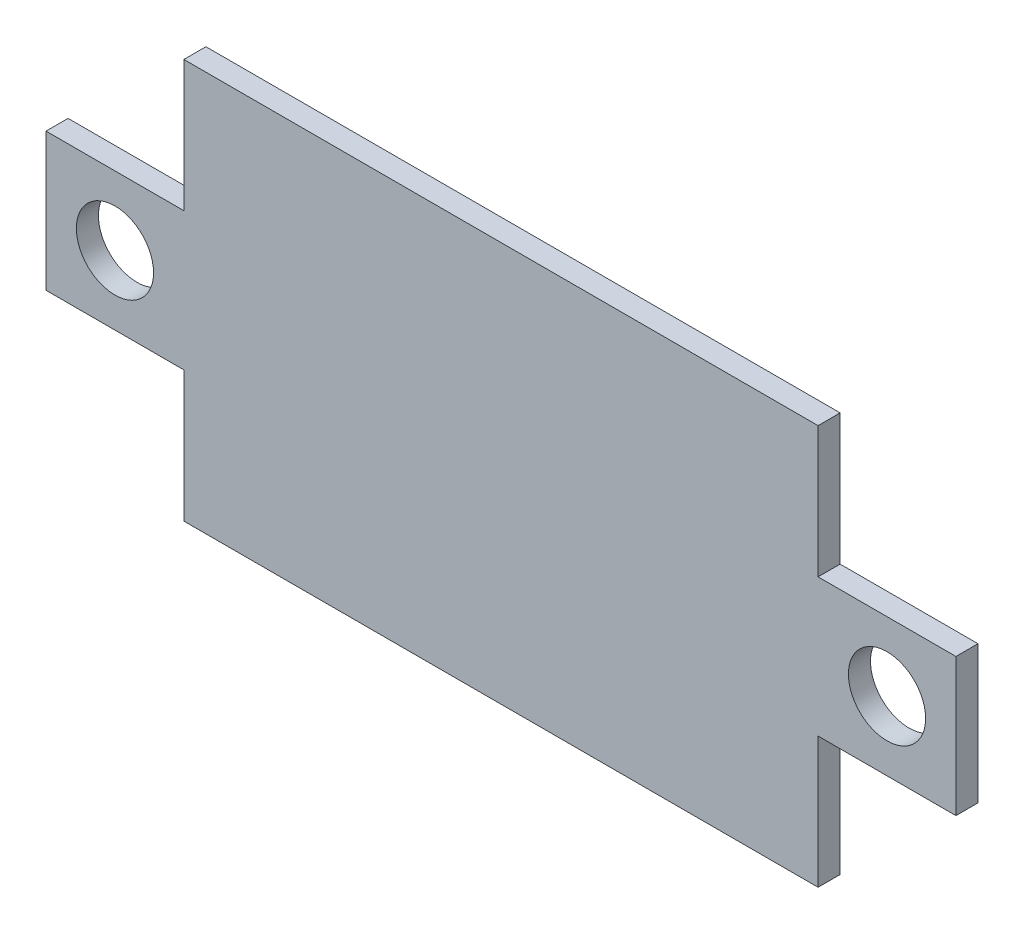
ISO-10303-21;
HEADER;
FILE_DESCRIPTION(('STEP AP214'),'2;1');
FILE_NAME('part.step','',(''),(''),'','','');
FILE_SCHEMA(('AUTOMOTIVE_DESIGN { 1 0 10303 214 1 1 1 1 }'));
ENDSEC;
DATA;
#1=APPLICATION_CONTEXT('core data for automotive mechanical design processes');
#2=APPLICATION_PROTOCOL_DEFINITION('international standard','automotive_design',2000,#1);
#3=PRODUCT_CONTEXT('',#1,'mechanical');
#4=PRODUCT('Part','Part','',(#3));
#5=PRODUCT_RELATED_PRODUCT_CATEGORY('part','',(#4));
#6=PRODUCT_DEFINITION_FORMATION('','',#4);
#7=PRODUCT_DEFINITION_CONTEXT('part definition',#1,'design');
#8=PRODUCT_DEFINITION('design','',#6,#7);
#9=PRODUCT_DEFINITION_SHAPE('','',#8);
#10=(LENGTH_UNIT() NAMED_UNIT(*) SI_UNIT(.MILLI.,.METRE.));
#11=(NAMED_UNIT(*) PLANE_ANGLE_UNIT() SI_UNIT($,.RADIAN.));
#12=(NAMED_UNIT(*) SI_UNIT($,.STERADIAN.) SOLID_ANGLE_UNIT());
#13=UNCERTAINTY_MEASURE_WITH_UNIT(LENGTH_MEASURE(1.E-05),#10,'distance_accuracy_value','');
#14=(GEOMETRIC_REPRESENTATION_CONTEXT(3) GLOBAL_UNCERTAINTY_ASSIGNED_CONTEXT((#13)) GLOBAL_UNIT_ASSIGNED_CONTEXT((#10,
#11,#12)) REPRESENTATION_CONTEXT('',''));
#15=CARTESIAN_POINT('',(0.,0.,0.));
#16=DIRECTION('',(0.,0.,1.));
#17=DIRECTION('',(1.,0.,0.));
#18=AXIS2_PLACEMENT_3D('',#15,#16,#17);
#19=CARTESIAN_POINT('',(0.,0.,0.4));
#20=DIRECTION('',(0.,-1.,0.));
#21=DIRECTION('',(0.,0.,-1.));
#22=AXIS2_PLACEMENT_3D('',#19,#20,#21);
#23=PLANE('',#22);
#24=DIRECTION('',(-1.,0.,0.));
#25=VECTOR('',#24,1.);
#26=CARTESIAN_POINT('',(0.,0.,-0.4));
#27=LINE('',#26,#25);
#28=CARTESIAN_POINT('',(0.,0.,-0.4));
#29=VERTEX_POINT('',#28);
#30=CARTESIAN_POINT('',(-23.,0.,-0.4));
#31=VERTEX_POINT('',#30);
#32=EDGE_CURVE('E177',#29,#31,#27,.T.);
#33=ORIENTED_EDGE('',*,*,#32,.T.);
#34=DIRECTION('',(0.,0.,-1.));
#35=VECTOR('',#34,1.);
#36=CARTESIAN_POINT('',(-23.,0.,0.4));
#37=LINE('',#36,#35);
#38=CARTESIAN_POINT('',(-23.,0.,0.4));
#39=VERTEX_POINT('',#38);
#40=EDGE_CURVE('E11',#39,#31,#37,.T.);
#41=ORIENTED_EDGE('',*,*,#40,.F.);
#42=DIRECTION('',(-1.,0.,0.));
#43=VECTOR('',#42,1.);
#44=CARTESIAN_POINT('',(0.,0.,0.4));
#45=LINE('',#44,#43);
#46=CARTESIAN_POINT('',(0.,0.,0.4));
#47=VERTEX_POINT('',#46);
#48=EDGE_CURVE('E221',#47,#39,#45,.T.);
#49=ORIENTED_EDGE('',*,*,#48,.F.);
#50=DIRECTION('',(0.,0.,-1.));
#51=VECTOR('',#50,1.);
#52=CARTESIAN_POINT('',(0.,0.,0.4));
#53=LINE('',#52,#51);
#54=EDGE_CURVE('E58',#47,#29,#53,.T.);
#55=ORIENTED_EDGE('',*,*,#54,.T.);
#56=EDGE_LOOP('',(#33,#41,#49,#55));
#57=FACE_BOUND('',#56,.T.);
#58=ADVANCED_FACE('F41',(#57),#23,.F.);
#59=CARTESIAN_POINT('',(-23.,0.,0.4));
#60=DIRECTION('',(1.,0.,0.));
#61=DIRECTION('',(0.,1.,0.));
#62=AXIS2_PLACEMENT_3D('',#59,#60,#61);
#63=PLANE('',#62);
#64=DIRECTION('',(0.,-1.,0.));
#65=VECTOR('',#64,1.);
#66=CARTESIAN_POINT('',(-23.,0.,-0.4));
#67=LINE('',#66,#65);
#68=CARTESIAN_POINT('',(-23.,-4.75,-0.4));
#69=VERTEX_POINT('',#68);
#70=EDGE_CURVE('E180',#31,#69,#67,.T.);
#71=ORIENTED_EDGE('',*,*,#70,.T.);
#72=DIRECTION('',(0.,0.,-1.));
#73=VECTOR('',#72,1.);
#74=CARTESIAN_POINT('',(-23.,-4.75,0.4));
#75=LINE('',#74,#73);
#76=CARTESIAN_POINT('',(-23.,-4.75,0.4));
#77=VERTEX_POINT('',#76);
#78=EDGE_CURVE('E50',#77,#69,#75,.T.);
#79=ORIENTED_EDGE('',*,*,#78,.F.);
#80=DIRECTION('',(0.,-1.,0.));
#81=VECTOR('',#80,1.);
#82=CARTESIAN_POINT('',(-23.,0.,0.4));
#83=LINE('',#82,#81);
#84=EDGE_CURVE('E108',#39,#77,#83,.T.);
#85=ORIENTED_EDGE('',*,*,#84,.F.);
#86=ORIENTED_EDGE('',*,*,#40,.T.);
#87=EDGE_LOOP('',(#71,#79,#85,#86));
#88=FACE_BOUND('',#87,.T.);
#89=ADVANCED_FACE('F291',(#88),#63,.F.);
#90=CARTESIAN_POINT('',(0.,-4.75000000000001,0.4));
#91=DIRECTION('',(0.,-1.,0.));
#92=DIRECTION('',(1.,0.,0.));
#93=AXIS2_PLACEMENT_3D('',#90,#91,#92);
#94=PLANE('',#93);
#95=DIRECTION('',(-1.,0.,0.));
#96=VECTOR('',#95,1.);
#97=CARTESIAN_POINT('',(0.,-4.75000000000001,-0.4));
#98=LINE('',#97,#96);
#99=CARTESIAN_POINT('',(-28.,-4.75,-0.4));
#100=VERTEX_POINT('',#99);
#101=EDGE_CURVE('E183',#69,#100,#98,.T.);
#102=ORIENTED_EDGE('',*,*,#101,.T.);
#103=DIRECTION('',(0.,0.,-1.));
#104=VECTOR('',#103,1.);
#105=CARTESIAN_POINT('',(-28.,-4.75,0.4));
#106=LINE('',#105,#104);
#107=CARTESIAN_POINT('',(-28.,-4.75,0.4));
#108=VERTEX_POINT('',#107);
#109=EDGE_CURVE('E243',#108,#100,#106,.T.);
#110=ORIENTED_EDGE('',*,*,#109,.F.);
#111=DIRECTION('',(-1.,0.,0.));
#112=VECTOR('',#111,1.);
#113=CARTESIAN_POINT('',(0.,-4.75000000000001,0.4));
#114=LINE('',#113,#112);
#115=EDGE_CURVE('E253',#77,#108,#114,.T.);
#116=ORIENTED_EDGE('',*,*,#115,.F.);
#117=ORIENTED_EDGE('',*,*,#78,.T.);
#118=EDGE_LOOP('',(#102,#110,#116,#117));
#119=FACE_BOUND('',#118,.T.);
#120=ADVANCED_FACE('F251',(#119),#94,.F.);
#121=CARTESIAN_POINT('',(-28.,0.,0.4));
#122=DIRECTION('',(1.,0.,0.));
#123=DIRECTION('',(0.,0.,-1.));
#124=AXIS2_PLACEMENT_3D('',#121,#122,#123);
#125=PLANE('',#124);
#126=DIRECTION('',(0.,-1.,0.));
#127=VECTOR('',#126,1.);
#128=CARTESIAN_POINT('',(-28.,0.,-0.4));
#129=LINE('',#128,#127);
#130=CARTESIAN_POINT('',(-28.,-9.75,-0.4));
#131=VERTEX_POINT('',#130);
#132=EDGE_CURVE('E187',#100,#131,#129,.T.);
#133=ORIENTED_EDGE('',*,*,#132,.T.);
#134=DIRECTION('',(0.,0.,-1.));
#135=VECTOR('',#134,1.);
#136=CARTESIAN_POINT('',(-28.,-9.75,0.4));
#137=LINE('',#136,#135);
#138=CARTESIAN_POINT('',(-28.,-9.75,0.4));
#139=VERTEX_POINT('',#138);
#140=EDGE_CURVE('E240',#139,#131,#137,.T.);
#141=ORIENTED_EDGE('',*,*,#140,.F.);
#142=DIRECTION('',(0.,-1.,0.));
#143=VECTOR('',#142,1.);
#144=CARTESIAN_POINT('',(-28.,0.,0.4));
#145=LINE('',#144,#143);
#146=EDGE_CURVE('E265',#108,#139,#145,.T.);
#147=ORIENTED_EDGE('',*,*,#146,.F.);
#148=ORIENTED_EDGE('',*,*,#109,.T.);
#149=EDGE_LOOP('',(#133,#141,#147,#148));
#150=FACE_BOUND('',#149,.T.);
#151=ADVANCED_FACE('F262',(#150),#125,.F.);
#152=CARTESIAN_POINT('',(0.,-9.74999999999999,0.4));
#153=DIRECTION('',(0.,-1.,0.));
#154=DIRECTION('',(1.,0.,0.));
#155=AXIS2_PLACEMENT_3D('',#152,#153,#154);
#156=PLANE('',#155);
#157=DIRECTION('',(-1.,0.,0.));
#158=VECTOR('',#157,1.);
#159=CARTESIAN_POINT('',(0.,-9.74999999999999,-0.4));
#160=LINE('',#159,#158);
#161=CARTESIAN_POINT('',(-23.,-9.75,-0.4));
#162=VERTEX_POINT('',#161);
#163=EDGE_CURVE('E191',#162,#131,#160,.T.);
#164=ORIENTED_EDGE('',*,*,#163,.F.);
#165=DIRECTION('',(0.,0.,-1.));
#166=VECTOR('',#165,1.);
#167=CARTESIAN_POINT('',(-23.,-9.75,0.4));
#168=LINE('',#167,#166);
#169=CARTESIAN_POINT('',(-23.,-9.75,0.4));
#170=VERTEX_POINT('',#169);
#171=EDGE_CURVE('E237',#170,#162,#168,.T.);
#172=ORIENTED_EDGE('',*,*,#171,.F.);
#173=DIRECTION('',(-1.,0.,0.));
#174=VECTOR('',#173,1.);
#175=CARTESIAN_POINT('',(0.,-9.74999999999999,0.4));
#176=LINE('',#175,#174);
#177=EDGE_CURVE('E268',#170,#139,#176,.T.);
#178=ORIENTED_EDGE('',*,*,#177,.T.);
#179=ORIENTED_EDGE('',*,*,#140,.T.);
#180=EDGE_LOOP('',(#164,#172,#178,#179));
#181=FACE_BOUND('',#180,.T.);
#182=ADVANCED_FACE('F303',(#181),#156,.T.);
#183=CARTESIAN_POINT('',(-23.,-14.5,-0.4));
#184=VERTEX_POINT('',#183);
#185=EDGE_CURVE('E184',#162,#184,#67,.T.);
#186=ORIENTED_EDGE('',*,*,#185,.T.);
#187=DIRECTION('',(0.,0.,-1.));
#188=VECTOR('',#187,1.);
#189=CARTESIAN_POINT('',(-23.,-14.5,0.4));
#190=LINE('',#189,#188);
#191=CARTESIAN_POINT('',(-23.,-14.5,0.4));
#192=VERTEX_POINT('',#191);
#193=EDGE_CURVE('E234',#192,#184,#190,.T.);
#194=ORIENTED_EDGE('',*,*,#193,.F.);
#195=EDGE_CURVE('E272',#170,#192,#83,.T.);
#196=ORIENTED_EDGE('',*,*,#195,.F.);
#197=ORIENTED_EDGE('',*,*,#171,.T.);
#198=EDGE_LOOP('',(#186,#194,#196,#197));
#199=FACE_BOUND('',#198,.T.);
#200=ADVANCED_FACE('F294',(#199),#63,.F.);
#201=CARTESIAN_POINT('',(0.,-14.5,0.4));
#202=DIRECTION('',(0.,-1.,0.));
#203=DIRECTION('',(1.,0.,0.));
#204=AXIS2_PLACEMENT_3D('',#201,#202,#203);
#205=PLANE('',#204);
#206=DIRECTION('',(-1.,0.,0.));
#207=VECTOR('',#206,1.);
#208=CARTESIAN_POINT('',(0.,-14.5,-0.4));
#209=LINE('',#208,#207);
#210=CARTESIAN_POINT('',(0.,-14.5,-0.4));
#211=VERTEX_POINT('',#210);
#212=EDGE_CURVE('E195',#211,#184,#209,.T.);
#213=ORIENTED_EDGE('',*,*,#212,.F.);
#214=DIRECTION('',(0.,0.,-1.));
#215=VECTOR('',#214,1.);
#216=CARTESIAN_POINT('',(0.,-14.5,0.4));
#217=LINE('',#216,#215);
#218=CARTESIAN_POINT('',(0.,-14.5,0.4));
#219=VERTEX_POINT('',#218);
#220=EDGE_CURVE('E231',#219,#211,#217,.T.);
#221=ORIENTED_EDGE('',*,*,#220,.F.);
#222=DIRECTION('',(-1.,0.,0.));
#223=VECTOR('',#222,1.);
#224=CARTESIAN_POINT('',(0.,-14.5,0.4));
#225=LINE('',#224,#223);
#226=EDGE_CURVE('E277',#219,#192,#225,.T.);
#227=ORIENTED_EDGE('',*,*,#226,.T.);
#228=ORIENTED_EDGE('',*,*,#193,.T.);
#229=EDGE_LOOP('',(#213,#221,#227,#228));
#230=FACE_BOUND('',#229,.T.);
#231=ADVANCED_FACE('F302',(#230),#205,.T.);
#232=CARTESIAN_POINT('',(0.,0.,0.4));
#233=DIRECTION('',(1.,0.,0.));
#234=DIRECTION('',(0.,1.,0.));
#235=AXIS2_PLACEMENT_3D('',#232,#233,#234);
#236=PLANE('',#235);
#237=DIRECTION('',(0.,-1.,0.));
#238=VECTOR('',#237,1.);
#239=CARTESIAN_POINT('',(0.,0.,-0.4));
#240=LINE('',#239,#238);
#241=CARTESIAN_POINT('',(0.,-9.75,-0.4));
#242=VERTEX_POINT('',#241);
#243=EDGE_CURVE('E199',#242,#211,#240,.T.);
#244=ORIENTED_EDGE('',*,*,#243,.F.);
#245=DIRECTION('',(0.,0.,-1.));
#246=VECTOR('',#245,1.);
#247=CARTESIAN_POINT('',(0.,-9.75,0.4));
#248=LINE('',#247,#246);
#249=CARTESIAN_POINT('',(0.,-9.75,0.4));
#250=VERTEX_POINT('',#249);
#251=EDGE_CURVE('E228',#250,#242,#248,.T.);
#252=ORIENTED_EDGE('',*,*,#251,.F.);
#253=DIRECTION('',(0.,-1.,0.));
#254=VECTOR('',#253,1.);
#255=CARTESIAN_POINT('',(0.,0.,0.4));
#256=LINE('',#255,#254);
#257=EDGE_CURVE('E167',#250,#219,#256,.T.);
#258=ORIENTED_EDGE('',*,*,#257,.T.);
#259=ORIENTED_EDGE('',*,*,#220,.T.);
#260=EDGE_LOOP('',(#244,#252,#258,#259));
#261=FACE_BOUND('',#260,.T.);
#262=ADVANCED_FACE('F309',(#261),#236,.T.);
#263=CARTESIAN_POINT('',(0.,-9.75,0.4));
#264=DIRECTION('',(0.,1.,0.));
#265=DIRECTION('',(0.,0.,1.));
#266=AXIS2_PLACEMENT_3D('',#263,#264,#265);
#267=PLANE('',#266);
#268=DIRECTION('',(1.,0.,0.));
#269=VECTOR('',#268,1.);
#270=CARTESIAN_POINT('',(0.,-9.75,-0.4));
#271=LINE('',#270,#269);
#272=CARTESIAN_POINT('',(5.,-9.75,-0.4));
#273=VERTEX_POINT('',#272);
#274=EDGE_CURVE('E203',#242,#273,#271,.T.);
#275=ORIENTED_EDGE('',*,*,#274,.T.);
#276=DIRECTION('',(0.,0.,-1.));
#277=VECTOR('',#276,1.);
#278=CARTESIAN_POINT('',(5.,-9.75,0.4));
#279=LINE('',#278,#277);
#280=CARTESIAN_POINT('',(5.,-9.75,0.4));
#281=VERTEX_POINT('',#280);
#282=EDGE_CURVE('E146',#281,#273,#279,.T.);
#283=ORIENTED_EDGE('',*,*,#282,.F.);
#284=DIRECTION('',(1.,0.,0.));
#285=VECTOR('',#284,1.);
#286=CARTESIAN_POINT('',(0.,-9.75,0.4));
#287=LINE('',#286,#285);
#288=EDGE_CURVE('E156',#250,#281,#287,.T.);
#289=ORIENTED_EDGE('',*,*,#288,.F.);
#290=ORIENTED_EDGE('',*,*,#251,.T.);
#291=EDGE_LOOP('',(#275,#283,#289,#290));
#292=FACE_BOUND('',#291,.T.);
#293=ADVANCED_FACE('F319',(#292),#267,.F.);
#294=CARTESIAN_POINT('',(5.,0.,0.4));
#295=DIRECTION('',(1.,0.,0.));
#296=DIRECTION('',(0.,1.,0.));
#297=AXIS2_PLACEMENT_3D('',#294,#295,#296);
#298=PLANE('',#297);
#299=DIRECTION('',(0.,-1.,0.));
#300=VECTOR('',#299,1.);
#301=CARTESIAN_POINT('',(5.,0.,-0.4));
#302=LINE('',#301,#300);
#303=CARTESIAN_POINT('',(5.,-4.75,-0.4));
#304=VERTEX_POINT('',#303);
#305=EDGE_CURVE('E141',#304,#273,#302,.T.);
#306=ORIENTED_EDGE('',*,*,#305,.F.);
#307=DIRECTION('',(0.,0.,-1.));
#308=VECTOR('',#307,1.);
#309=CARTESIAN_POINT('',(5.,-4.75,0.4));
#310=LINE('',#309,#308);
#311=CARTESIAN_POINT('',(5.,-4.75,0.4));
#312=VERTEX_POINT('',#311);
#313=EDGE_CURVE('E136',#312,#304,#310,.T.);
#314=ORIENTED_EDGE('',*,*,#313,.F.);
#315=DIRECTION('',(0.,-1.,0.));
#316=VECTOR('',#315,1.);
#317=CARTESIAN_POINT('',(5.,0.,0.4));
#318=LINE('',#317,#316);
#319=EDGE_CURVE('E139',#312,#281,#318,.T.);
#320=ORIENTED_EDGE('',*,*,#319,.T.);
#321=ORIENTED_EDGE('',*,*,#282,.T.);
#322=EDGE_LOOP('',(#306,#314,#320,#321));
#323=FACE_BOUND('',#322,.T.);
#324=ADVANCED_FACE('F138',(#323),#298,.T.);
#325=CARTESIAN_POINT('',(0.,-4.75,0.4));
#326=DIRECTION('',(0.,1.,0.));
#327=DIRECTION('',(-1.,0.,0.));
#328=AXIS2_PLACEMENT_3D('',#325,#326,#327);
#329=PLANE('',#328);
#330=DIRECTION('',(1.,0.,0.));
#331=VECTOR('',#330,1.);
#332=CARTESIAN_POINT('',(0.,-4.75,-0.4));
#333=LINE('',#332,#331);
#334=CARTESIAN_POINT('',(0.,-4.75,-0.4));
#335=VERTEX_POINT('',#334);
#336=EDGE_CURVE('E210',#335,#304,#333,.T.);
#337=ORIENTED_EDGE('',*,*,#336,.F.);
#338=DIRECTION('',(0.,0.,-1.));
#339=VECTOR('',#338,1.);
#340=CARTESIAN_POINT('',(0.,-4.75,0.4));
#341=LINE('',#340,#339);
#342=CARTESIAN_POINT('',(0.,-4.75,0.4));
#343=VERTEX_POINT('',#342);
#344=EDGE_CURVE('E96',#343,#335,#341,.T.);
#345=ORIENTED_EDGE('',*,*,#344,.F.);
#346=DIRECTION('',(1.,0.,0.));
#347=VECTOR('',#346,1.);
#348=CARTESIAN_POINT('',(0.,-4.75,0.4));
#349=LINE('',#348,#347);
#350=EDGE_CURVE('E153',#343,#312,#349,.T.);
#351=ORIENTED_EDGE('',*,*,#350,.T.);
#352=ORIENTED_EDGE('',*,*,#313,.T.);
#353=EDGE_LOOP('',(#337,#345,#351,#352));
#354=FACE_BOUND('',#353,.T.);
#355=ADVANCED_FACE('F160',(#354),#329,.T.);
#356=CARTESIAN_POINT('',(2.5,-7.25,0.4));
#357=DIRECTION('',(0.,0.,-1.));
#358=DIRECTION('',(-1.,0.,0.));
#359=AXIS2_PLACEMENT_3D('',#356,#357,#358);
#360=CYLINDRICAL_SURFACE('',#359,1.4);
#361=CARTESIAN_POINT('',(2.5,-7.25,0.4));
#362=DIRECTION('',(0.,0.,1.));
#363=DIRECTION('',(1.,0.,0.));
#364=AXIS2_PLACEMENT_3D('',#361,#362,#363);
#365=CIRCLE('',#364,1.4);
#366=CARTESIAN_POINT('',(3.9,-7.25,0.4));
#367=VERTEX_POINT('',#366);
#368=EDGE_CURVE('E165',#367,#367,#365,.T.);
#369=ORIENTED_EDGE('',*,*,#368,.T.);
#370=EDGE_LOOP('',(#369));
#371=FACE_BOUND('',#370,.T.);
#372=CARTESIAN_POINT('',(2.5,-7.25,-0.4));
#373=DIRECTION('',(0.,0.,1.));
#374=DIRECTION('',(1.,0.,0.));
#375=AXIS2_PLACEMENT_3D('',#372,#373,#374);
#376=CIRCLE('',#375,1.4);
#377=CARTESIAN_POINT('',(3.9,-7.25,-0.4));
#378=VERTEX_POINT('',#377);
#379=EDGE_CURVE('E213',#378,#378,#376,.T.);
#380=ORIENTED_EDGE('',*,*,#379,.F.);
#381=EDGE_LOOP('',(#380));
#382=FACE_BOUND('',#381,.T.);
#383=ADVANCED_FACE('F325',(#371,#382),#360,.F.);
#384=EDGE_CURVE('E204',#29,#335,#240,.T.);
#385=ORIENTED_EDGE('',*,*,#384,.F.);
#386=ORIENTED_EDGE('',*,*,#54,.F.);
#387=EDGE_CURVE('E162',#47,#343,#256,.T.);
#388=ORIENTED_EDGE('',*,*,#387,.T.);
#389=ORIENTED_EDGE('',*,*,#344,.T.);
#390=EDGE_LOOP('',(#385,#386,#388,#389));
#391=FACE_BOUND('',#390,.T.);
#392=ADVANCED_FACE('F322',(#391),#236,.T.);
#393=CARTESIAN_POINT('',(-25.5,-7.25,0.4));
#394=DIRECTION('',(0.,0.,-1.));
#395=DIRECTION('',(-1.,0.,0.));
#396=AXIS2_PLACEMENT_3D('',#393,#394,#395);
#397=CYLINDRICAL_SURFACE('',#396,1.4);
#398=CARTESIAN_POINT('',(-25.5,-7.25,0.4));
#399=DIRECTION('',(0.,0.,1.));
#400=DIRECTION('',(1.,0.,0.));
#401=AXIS2_PLACEMENT_3D('',#398,#399,#400);
#402=CIRCLE('',#401,1.4);
#403=CARTESIAN_POINT('',(-24.1,-7.25,0.4));
#404=VERTEX_POINT('',#403);
#405=EDGE_CURVE('E173',#404,#404,#402,.T.);
#406=ORIENTED_EDGE('',*,*,#405,.T.);
#407=EDGE_LOOP('',(#406));
#408=FACE_BOUND('',#407,.T.);
#409=CARTESIAN_POINT('',(-25.5,-7.25,-0.4));
#410=DIRECTION('',(0.,0.,1.));
#411=DIRECTION('',(1.,0.,0.));
#412=AXIS2_PLACEMENT_3D('',#409,#410,#411);
#413=CIRCLE('',#412,1.4);
#414=CARTESIAN_POINT('',(-24.1,-7.25,-0.4));
#415=VERTEX_POINT('',#414);
#416=EDGE_CURVE('E217',#415,#415,#413,.T.);
#417=ORIENTED_EDGE('',*,*,#416,.F.);
#418=EDGE_LOOP('',(#417));
#419=FACE_BOUND('',#418,.T.);
#420=ADVANCED_FACE('F324',(#408,#419),#397,.F.);
#421=CARTESIAN_POINT('',(0.,0.,0.4));
#422=DIRECTION('',(0.,0.,1.));
#423=DIRECTION('',(1.,0.,0.));
#424=AXIS2_PLACEMENT_3D('',#421,#422,#423);
#425=PLANE('',#424);
#426=ORIENTED_EDGE('',*,*,#48,.T.);
#427=ORIENTED_EDGE('',*,*,#84,.T.);
#428=ORIENTED_EDGE('',*,*,#115,.T.);
#429=ORIENTED_EDGE('',*,*,#146,.T.);
#430=ORIENTED_EDGE('',*,*,#177,.F.);
#431=ORIENTED_EDGE('',*,*,#195,.T.);
#432=ORIENTED_EDGE('',*,*,#226,.F.);
#433=ORIENTED_EDGE('',*,*,#257,.F.);
#434=ORIENTED_EDGE('',*,*,#288,.T.);
#435=ORIENTED_EDGE('',*,*,#319,.F.);
#436=ORIENTED_EDGE('',*,*,#350,.F.);
#437=ORIENTED_EDGE('',*,*,#387,.F.);
#438=EDGE_LOOP('',(#426,#427,#428,#429,#430,#431,#432,#433,#434,#435,#436,#437));
#439=FACE_BOUND('',#438,.T.);
#440=ORIENTED_EDGE('',*,*,#368,.F.);
#441=EDGE_LOOP('',(#440));
#442=FACE_BOUND('',#441,.T.);
#443=ORIENTED_EDGE('',*,*,#405,.F.);
#444=EDGE_LOOP('',(#443));
#445=FACE_BOUND('',#444,.T.);
#446=ADVANCED_FACE('F150',(#439,#442,#445),#425,.T.);
#447=CARTESIAN_POINT('',(0.,0.,-0.4));
#448=DIRECTION('',(0.,0.,1.));
#449=DIRECTION('',(1.,0.,0.));
#450=AXIS2_PLACEMENT_3D('',#447,#448,#449);
#451=PLANE('',#450);
#452=ORIENTED_EDGE('',*,*,#32,.F.);
#453=ORIENTED_EDGE('',*,*,#384,.T.);
#454=ORIENTED_EDGE('',*,*,#336,.T.);
#455=ORIENTED_EDGE('',*,*,#305,.T.);
#456=ORIENTED_EDGE('',*,*,#274,.F.);
#457=ORIENTED_EDGE('',*,*,#243,.T.);
#458=ORIENTED_EDGE('',*,*,#212,.T.);
#459=ORIENTED_EDGE('',*,*,#185,.F.);
#460=ORIENTED_EDGE('',*,*,#163,.T.);
#461=ORIENTED_EDGE('',*,*,#132,.F.);
#462=ORIENTED_EDGE('',*,*,#101,.F.);
#463=ORIENTED_EDGE('',*,*,#70,.F.);
#464=EDGE_LOOP('',(#452,#453,#454,#455,#456,#457,#458,#459,#460,#461,#462,#463));
#465=FACE_BOUND('',#464,.T.);
#466=ORIENTED_EDGE('',*,*,#379,.T.);
#467=EDGE_LOOP('',(#466));
#468=FACE_BOUND('',#467,.T.);
#469=ORIENTED_EDGE('',*,*,#416,.T.);
#470=EDGE_LOOP('',(#469));
#471=FACE_BOUND('',#470,.T.);
#472=ADVANCED_FACE('F256',(#465,#468,#471),#451,.F.);
#473=CLOSED_SHELL('',(#58,#89,#120,#151,#182,#200,#231,#262,#293,#324,#355,#383,#392,#420,#446,#472));
#474=MANIFOLD_SOLID_BREP('B2',#473);
#475=ADVANCED_BREP_SHAPE_REPRESENTATION('',(#18,#474),#14);
#476=SHAPE_DEFINITION_REPRESENTATION(#9,#475);
ENDSEC;
END-ISO-10303-21;
